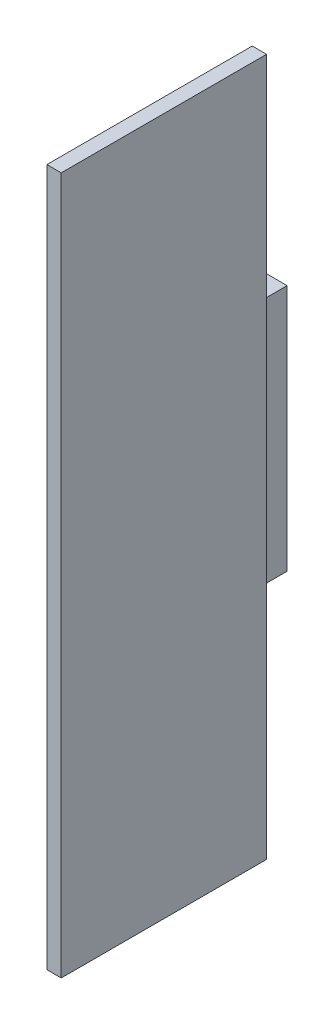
ISO-10303-21;
HEADER;
FILE_DESCRIPTION(('STEP AP214'),'2;1');
FILE_NAME('part.step','',(''),(''),'','','');
FILE_SCHEMA(('AUTOMOTIVE_DESIGN { 1 0 10303 214 1 1 1 1 }'));
ENDSEC;
DATA;
#1=APPLICATION_CONTEXT('core data for automotive mechanical design processes');
#2=APPLICATION_PROTOCOL_DEFINITION('international standard','automotive_design',2000,#1);
#3=PRODUCT_CONTEXT('',#1,'mechanical');
#4=PRODUCT('Part','Part','',(#3));
#5=PRODUCT_RELATED_PRODUCT_CATEGORY('part','',(#4));
#6=PRODUCT_DEFINITION_FORMATION('','',#4);
#7=PRODUCT_DEFINITION_CONTEXT('part definition',#1,'design');
#8=PRODUCT_DEFINITION('design','',#6,#7);
#9=PRODUCT_DEFINITION_SHAPE('','',#8);
#10=(LENGTH_UNIT() NAMED_UNIT(*) SI_UNIT(.MILLI.,.METRE.));
#11=(NAMED_UNIT(*) PLANE_ANGLE_UNIT() SI_UNIT($,.RADIAN.));
#12=(NAMED_UNIT(*) SI_UNIT($,.STERADIAN.) SOLID_ANGLE_UNIT());
#13=UNCERTAINTY_MEASURE_WITH_UNIT(LENGTH_MEASURE(1.E-05),#10,'distance_accuracy_value','');
#14=(GEOMETRIC_REPRESENTATION_CONTEXT(3) GLOBAL_UNCERTAINTY_ASSIGNED_CONTEXT((#13)) GLOBAL_UNIT_ASSIGNED_CONTEXT((#10,
#11,#12)) REPRESENTATION_CONTEXT('',''));
#15=CARTESIAN_POINT('',(0.,0.,0.));
#16=DIRECTION('',(0.,0.,1.));
#17=DIRECTION('',(1.,0.,0.));
#18=AXIS2_PLACEMENT_3D('',#15,#16,#17);
#19=CARTESIAN_POINT('',(0.,73.,43.));
#20=DIRECTION('',(-1.,0.,0.));
#21=DIRECTION('',(0.,-1.,0.));
#22=AXIS2_PLACEMENT_3D('',#19,#20,#21);
#23=PLANE('',#22);
#24=DIRECTION('',(0.,-1.,0.));
#25=VECTOR('',#24,1.);
#26=CARTESIAN_POINT('',(0.,-35.,7.69999999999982));
#27=LINE('',#26,#25);
#28=CARTESIAN_POINT('',(0.,35.,7.69999999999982));
#29=VERTEX_POINT('',#28);
#30=CARTESIAN_POINT('',(0.,-35.,7.69999999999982));
#31=VERTEX_POINT('',#30);
#32=EDGE_CURVE('E32',#29,#31,#27,.T.);
#33=ORIENTED_EDGE('',*,*,#32,.T.);
#34=DIRECTION('',(0.,0.,-1.));
#35=VECTOR('',#34,1.);
#36=CARTESIAN_POINT('',(0.,-35.,0.));
#37=LINE('',#36,#35);
#38=CARTESIAN_POINT('',(0.,-35.,0.));
#39=VERTEX_POINT('',#38);
#40=EDGE_CURVE('E18',#31,#39,#37,.T.);
#41=ORIENTED_EDGE('',*,*,#40,.T.);
#42=DIRECTION('',(0.,1.,0.));
#43=VECTOR('',#42,1.);
#44=CARTESIAN_POINT('',(0.,-73.,0.));
#45=LINE('',#44,#43);
#46=CARTESIAN_POINT('',(0.,-73.,0.));
#47=VERTEX_POINT('',#46);
#48=EDGE_CURVE('E178',#47,#39,#45,.T.);
#49=ORIENTED_EDGE('',*,*,#48,.F.);
#50=DIRECTION('',(0.,0.,-1.));
#51=VECTOR('',#50,1.);
#52=CARTESIAN_POINT('',(0.,-73.,43.));
#53=LINE('',#52,#51);
#54=CARTESIAN_POINT('',(0.,-73.,43.));
#55=VERTEX_POINT('',#54);
#56=EDGE_CURVE('E165',#55,#47,#53,.T.);
#57=ORIENTED_EDGE('',*,*,#56,.F.);
#58=DIRECTION('',(0.,-1.,0.));
#59=VECTOR('',#58,1.);
#60=CARTESIAN_POINT('',(0.,73.,43.));
#61=LINE('',#60,#59);
#62=CARTESIAN_POINT('',(0.,73.,43.));
#63=VERTEX_POINT('',#62);
#64=EDGE_CURVE('E155',#63,#55,#61,.T.);
#65=ORIENTED_EDGE('',*,*,#64,.F.);
#66=DIRECTION('',(0.,0.,1.));
#67=VECTOR('',#66,1.);
#68=CARTESIAN_POINT('',(0.,73.,0.));
#69=LINE('',#68,#67);
#70=CARTESIAN_POINT('',(0.,73.,0.));
#71=VERTEX_POINT('',#70);
#72=EDGE_CURVE('E170',#71,#63,#69,.T.);
#73=ORIENTED_EDGE('',*,*,#72,.F.);
#74=CARTESIAN_POINT('',(0.,34.9999999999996,0.));
#75=VERTEX_POINT('',#74);
#76=EDGE_CURVE('E167',#75,#71,#45,.T.);
#77=ORIENTED_EDGE('',*,*,#76,.F.);
#78=DIRECTION('',(0.,0.,1.));
#79=VECTOR('',#78,1.);
#80=CARTESIAN_POINT('',(0.,35.,7.69999999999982));
#81=LINE('',#80,#79);
#82=EDGE_CURVE('E125',#75,#29,#81,.T.);
#83=ORIENTED_EDGE('',*,*,#82,.T.);
#84=EDGE_LOOP('',(#33,#41,#49,#57,#65,#73,#77,#83));
#85=FACE_BOUND('',#84,.T.);
#86=ADVANCED_FACE('F14',(#85),#23,.T.);
#87=CARTESIAN_POINT('',(3.,73.,43.));
#88=DIRECTION('',(0.,0.,-1.));
#89=DIRECTION('',(0.,1.,0.));
#90=AXIS2_PLACEMENT_3D('',#87,#88,#89);
#91=PLANE('',#90);
#92=ORIENTED_EDGE('',*,*,#64,.T.);
#93=DIRECTION('',(-1.,0.,0.));
#94=VECTOR('',#93,1.);
#95=CARTESIAN_POINT('',(3.,-73.,43.));
#96=LINE('',#95,#94);
#97=CARTESIAN_POINT('',(3.,-73.,43.));
#98=VERTEX_POINT('',#97);
#99=EDGE_CURVE('E9',#98,#55,#96,.T.);
#100=ORIENTED_EDGE('',*,*,#99,.F.);
#101=DIRECTION('',(0.,-1.,0.));
#102=VECTOR('',#101,1.);
#103=CARTESIAN_POINT('',(3.,73.,43.));
#104=LINE('',#103,#102);
#105=CARTESIAN_POINT('',(3.,73.,43.));
#106=VERTEX_POINT('',#105);
#107=EDGE_CURVE('E196',#106,#98,#104,.T.);
#108=ORIENTED_EDGE('',*,*,#107,.F.);
#109=DIRECTION('',(-1.,0.,0.));
#110=VECTOR('',#109,1.);
#111=CARTESIAN_POINT('',(3.,73.,43.));
#112=LINE('',#111,#110);
#113=EDGE_CURVE('E193',#106,#63,#112,.T.);
#114=ORIENTED_EDGE('',*,*,#113,.T.);
#115=EDGE_LOOP('',(#92,#100,#108,#114));
#116=FACE_BOUND('',#115,.T.);
#117=ADVANCED_FACE('F16',(#116),#91,.F.);
#118=CARTESIAN_POINT('',(3.,-73.,43.));
#119=DIRECTION('',(0.,1.,0.));
#120=DIRECTION('',(0.,0.,1.));
#121=AXIS2_PLACEMENT_3D('',#118,#119,#120);
#122=PLANE('',#121);
#123=ORIENTED_EDGE('',*,*,#56,.T.);
#124=DIRECTION('',(-1.,0.,0.));
#125=VECTOR('',#124,1.);
#126=CARTESIAN_POINT('',(3.,-73.,0.));
#127=LINE('',#126,#125);
#128=CARTESIAN_POINT('',(3.,-73.,0.));
#129=VERTEX_POINT('',#128);
#130=EDGE_CURVE('E24',#129,#47,#127,.T.);
#131=ORIENTED_EDGE('',*,*,#130,.F.);
#132=DIRECTION('',(0.,0.,-1.));
#133=VECTOR('',#132,1.);
#134=CARTESIAN_POINT('',(3.,-73.,43.));
#135=LINE('',#134,#133);
#136=EDGE_CURVE('E197',#98,#129,#135,.T.);
#137=ORIENTED_EDGE('',*,*,#136,.F.);
#138=ORIENTED_EDGE('',*,*,#99,.T.);
#139=EDGE_LOOP('',(#123,#131,#137,#138));
#140=FACE_BOUND('',#139,.T.);
#141=ADVANCED_FACE('F208',(#140),#122,.F.);
#142=CARTESIAN_POINT('',(3.,-73.,0.));
#143=DIRECTION('',(0.,0.,1.));
#144=DIRECTION('',(1.,0.,0.));
#145=AXIS2_PLACEMENT_3D('',#142,#143,#144);
#146=PLANE('',#145);
#147=ORIENTED_EDGE('',*,*,#48,.T.);
#148=DIRECTION('',(1.,0.,0.));
#149=VECTOR('',#148,1.);
#150=CARTESIAN_POINT('',(-6.,-35.,0.));
#151=LINE('',#150,#149);
#152=CARTESIAN_POINT('',(-6.,-35.,0.));
#153=VERTEX_POINT('',#152);
#154=EDGE_CURVE('E113',#153,#39,#151,.T.);
#155=ORIENTED_EDGE('',*,*,#154,.F.);
#156=DIRECTION('',(0.,1.,0.));
#157=VECTOR('',#156,1.);
#158=CARTESIAN_POINT('',(-6.,-35.,0.));
#159=LINE('',#158,#157);
#160=CARTESIAN_POINT('',(-6.,-25.9,0.));
#161=VERTEX_POINT('',#160);
#162=EDGE_CURVE('E136',#153,#161,#159,.T.);
#163=ORIENTED_EDGE('',*,*,#162,.T.);
#164=DIRECTION('',(1.,0.,0.));
#165=VECTOR('',#164,1.);
#166=CARTESIAN_POINT('',(-6.,-25.9,0.));
#167=LINE('',#166,#165);
#168=CARTESIAN_POINT('',(0.,-25.9,0.));
#169=VERTEX_POINT('',#168);
#170=EDGE_CURVE('E161',#161,#169,#167,.T.);
#171=ORIENTED_EDGE('',*,*,#170,.T.);
#172=CARTESIAN_POINT('',(0.,25.9,0.));
#173=VERTEX_POINT('',#172);
#174=EDGE_CURVE('E179',#169,#173,#45,.T.);
#175=ORIENTED_EDGE('',*,*,#174,.T.);
#176=DIRECTION('',(1.,0.,0.));
#177=VECTOR('',#176,1.);
#178=CARTESIAN_POINT('',(-6.,25.9,0.));
#179=LINE('',#178,#177);
#180=CARTESIAN_POINT('',(-6.,25.9,0.));
#181=VERTEX_POINT('',#180);
#182=EDGE_CURVE('E159',#181,#173,#179,.T.);
#183=ORIENTED_EDGE('',*,*,#182,.F.);
#184=DIRECTION('',(0.,1.,0.));
#185=VECTOR('',#184,1.);
#186=CARTESIAN_POINT('',(-6.,25.9,0.));
#187=LINE('',#186,#185);
#188=CARTESIAN_POINT('',(-6.,34.9999999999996,0.));
#189=VERTEX_POINT('',#188);
#190=EDGE_CURVE('E148',#181,#189,#187,.T.);
#191=ORIENTED_EDGE('',*,*,#190,.T.);
#192=DIRECTION('',(1.,0.,0.));
#193=VECTOR('',#192,1.);
#194=CARTESIAN_POINT('',(-6.,34.9999999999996,0.));
#195=LINE('',#194,#193);
#196=EDGE_CURVE('E156',#189,#75,#195,.T.);
#197=ORIENTED_EDGE('',*,*,#196,.T.);
#198=ORIENTED_EDGE('',*,*,#76,.T.);
#199=DIRECTION('',(-1.,0.,0.));
#200=VECTOR('',#199,1.);
#201=CARTESIAN_POINT('',(3.,73.,0.));
#202=LINE('',#201,#200);
#203=CARTESIAN_POINT('',(3.,73.,0.));
#204=VERTEX_POINT('',#203);
#205=EDGE_CURVE('E188',#204,#71,#202,.T.);
#206=ORIENTED_EDGE('',*,*,#205,.F.);
#207=DIRECTION('',(0.,1.,0.));
#208=VECTOR('',#207,1.);
#209=CARTESIAN_POINT('',(3.,-73.,0.));
#210=LINE('',#209,#208);
#211=EDGE_CURVE('E200',#129,#204,#210,.T.);
#212=ORIENTED_EDGE('',*,*,#211,.F.);
#213=ORIENTED_EDGE('',*,*,#130,.T.);
#214=EDGE_LOOP('',(#147,#155,#163,#171,#175,#183,#191,#197,#198,#206,#212,#213));
#215=FACE_BOUND('',#214,.T.);
#216=ADVANCED_FACE('F186',(#215),#146,.F.);
#217=CARTESIAN_POINT('',(3.,73.,0.));
#218=DIRECTION('',(0.,-1.,0.));
#219=DIRECTION('',(0.,0.,-1.));
#220=AXIS2_PLACEMENT_3D('',#217,#218,#219);
#221=PLANE('',#220);
#222=ORIENTED_EDGE('',*,*,#72,.T.);
#223=ORIENTED_EDGE('',*,*,#113,.F.);
#224=DIRECTION('',(0.,0.,1.));
#225=VECTOR('',#224,1.);
#226=CARTESIAN_POINT('',(3.,73.,0.));
#227=LINE('',#226,#225);
#228=EDGE_CURVE('E40',#204,#106,#227,.T.);
#229=ORIENTED_EDGE('',*,*,#228,.F.);
#230=ORIENTED_EDGE('',*,*,#205,.T.);
#231=EDGE_LOOP('',(#222,#223,#229,#230));
#232=FACE_BOUND('',#231,.T.);
#233=ADVANCED_FACE('F191',(#232),#221,.F.);
#234=CARTESIAN_POINT('',(3.,73.,43.));
#235=DIRECTION('',(-1.,0.,0.));
#236=DIRECTION('',(0.,-1.,0.));
#237=AXIS2_PLACEMENT_3D('',#234,#235,#236);
#238=PLANE('',#237);
#239=ORIENTED_EDGE('',*,*,#107,.T.);
#240=ORIENTED_EDGE('',*,*,#136,.T.);
#241=ORIENTED_EDGE('',*,*,#211,.T.);
#242=ORIENTED_EDGE('',*,*,#228,.T.);
#243=EDGE_LOOP('',(#239,#240,#241,#242));
#244=FACE_BOUND('',#243,.T.);
#245=ADVANCED_FACE('F224',(#244),#238,.F.);
#246=CARTESIAN_POINT('',(0.,25.9,7.69999999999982));
#247=DIRECTION('',(1.,0.,0.));
#248=DIRECTION('',(0.,1.,0.));
#249=AXIS2_PLACEMENT_3D('',#246,#247,#248);
#250=PLANE('',#249);
#251=ORIENTED_EDGE('',*,*,#174,.F.);
#252=DIRECTION('',(0.,0.,-1.));
#253=VECTOR('',#252,1.);
#254=CARTESIAN_POINT('',(0.,-25.9,0.));
#255=LINE('',#254,#253);
#256=CARTESIAN_POINT('',(0.,-25.9,-7.30000000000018));
#257=VERTEX_POINT('',#256);
#258=EDGE_CURVE('E121',#169,#257,#255,.T.);
#259=ORIENTED_EDGE('',*,*,#258,.T.);
#260=DIRECTION('',(0.,1.,0.));
#261=VECTOR('',#260,1.);
#262=CARTESIAN_POINT('',(0.,-25.9,-7.30000000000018));
#263=LINE('',#262,#261);
#264=CARTESIAN_POINT('',(0.,25.9,-7.30000000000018));
#265=VERTEX_POINT('',#264);
#266=EDGE_CURVE('E129',#257,#265,#263,.T.);
#267=ORIENTED_EDGE('',*,*,#266,.T.);
#268=DIRECTION('',(0.,0.,1.));
#269=VECTOR('',#268,1.);
#270=CARTESIAN_POINT('',(0.,25.9,-7.30000000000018));
#271=LINE('',#270,#269);
#272=EDGE_CURVE('E132',#265,#173,#271,.T.);
#273=ORIENTED_EDGE('',*,*,#272,.T.);
#274=EDGE_LOOP('',(#251,#259,#267,#273));
#275=FACE_BOUND('',#274,.T.);
#276=ADVANCED_FACE('F227',(#275),#250,.T.);
#277=CARTESIAN_POINT('',(-6.,-35.,7.69999999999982));
#278=DIRECTION('',(0.,0.,1.));
#279=DIRECTION('',(1.,0.,0.));
#280=AXIS2_PLACEMENT_3D('',#277,#278,#279);
#281=PLANE('',#280);
#282=ORIENTED_EDGE('',*,*,#32,.F.);
#283=DIRECTION('',(1.,0.,0.));
#284=VECTOR('',#283,1.);
#285=CARTESIAN_POINT('',(-6.,35.,7.69999999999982));
#286=LINE('',#285,#284);
#287=CARTESIAN_POINT('',(-6.,35.,7.69999999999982));
#288=VERTEX_POINT('',#287);
#289=EDGE_CURVE('E153',#288,#29,#286,.T.);
#290=ORIENTED_EDGE('',*,*,#289,.F.);
#291=DIRECTION('',(0.,-1.,0.));
#292=VECTOR('',#291,1.);
#293=CARTESIAN_POINT('',(-6.,-35.,7.69999999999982));
#294=LINE('',#293,#292);
#295=CARTESIAN_POINT('',(-6.,-35.,7.69999999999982));
#296=VERTEX_POINT('',#295);
#297=EDGE_CURVE('E109',#288,#296,#294,.T.);
#298=ORIENTED_EDGE('',*,*,#297,.T.);
#299=DIRECTION('',(1.,0.,0.));
#300=VECTOR('',#299,1.);
#301=CARTESIAN_POINT('',(-6.,-35.,7.69999999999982));
#302=LINE('',#301,#300);
#303=EDGE_CURVE('E105',#296,#31,#302,.T.);
#304=ORIENTED_EDGE('',*,*,#303,.T.);
#305=EDGE_LOOP('',(#282,#290,#298,#304));
#306=FACE_BOUND('',#305,.T.);
#307=ADVANCED_FACE('F107',(#306),#281,.T.);
#308=CARTESIAN_POINT('',(-6.,35.,7.69999999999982));
#309=DIRECTION('',(0.,1.,0.));
#310=DIRECTION('',(0.,0.,1.));
#311=AXIS2_PLACEMENT_3D('',#308,#309,#310);
#312=PLANE('',#311);
#313=ORIENTED_EDGE('',*,*,#82,.F.);
#314=ORIENTED_EDGE('',*,*,#196,.F.);
#315=DIRECTION('',(0.,0.,1.));
#316=VECTOR('',#315,1.);
#317=CARTESIAN_POINT('',(-6.,35.,7.69999999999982));
#318=LINE('',#317,#316);
#319=EDGE_CURVE('E114',#189,#288,#318,.T.);
#320=ORIENTED_EDGE('',*,*,#319,.T.);
#321=ORIENTED_EDGE('',*,*,#289,.T.);
#322=EDGE_LOOP('',(#313,#314,#320,#321));
#323=FACE_BOUND('',#322,.T.);
#324=ADVANCED_FACE('F265',(#323),#312,.T.);
#325=CARTESIAN_POINT('',(-6.,25.9,-7.30000000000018));
#326=DIRECTION('',(0.,1.,0.));
#327=DIRECTION('',(-1.,0.,0.));
#328=AXIS2_PLACEMENT_3D('',#325,#326,#327);
#329=PLANE('',#328);
#330=ORIENTED_EDGE('',*,*,#272,.F.);
#331=DIRECTION('',(1.,0.,0.));
#332=VECTOR('',#331,1.);
#333=CARTESIAN_POINT('',(-6.,25.9,-7.30000000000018));
#334=LINE('',#333,#332);
#335=CARTESIAN_POINT('',(-6.,25.9,-7.30000000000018));
#336=VERTEX_POINT('',#335);
#337=EDGE_CURVE('E157',#336,#265,#334,.T.);
#338=ORIENTED_EDGE('',*,*,#337,.F.);
#339=DIRECTION('',(0.,0.,1.));
#340=VECTOR('',#339,1.);
#341=CARTESIAN_POINT('',(-6.,25.9,-7.30000000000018));
#342=LINE('',#341,#340);
#343=EDGE_CURVE('E145',#336,#181,#342,.T.);
#344=ORIENTED_EDGE('',*,*,#343,.T.);
#345=ORIENTED_EDGE('',*,*,#182,.T.);
#346=EDGE_LOOP('',(#330,#338,#344,#345));
#347=FACE_BOUND('',#346,.T.);
#348=ADVANCED_FACE('F272',(#347),#329,.T.);
#349=CARTESIAN_POINT('',(-6.,-25.9,-7.30000000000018));
#350=DIRECTION('',(0.,0.,-1.));
#351=DIRECTION('',(-1.,0.,0.));
#352=AXIS2_PLACEMENT_3D('',#349,#350,#351);
#353=PLANE('',#352);
#354=ORIENTED_EDGE('',*,*,#266,.F.);
#355=DIRECTION('',(1.,0.,0.));
#356=VECTOR('',#355,1.);
#357=CARTESIAN_POINT('',(-6.,-25.9,-7.30000000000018));
#358=LINE('',#357,#356);
#359=CARTESIAN_POINT('',(-6.,-25.9,-7.30000000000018));
#360=VERTEX_POINT('',#359);
#361=EDGE_CURVE('E160',#360,#257,#358,.T.);
#362=ORIENTED_EDGE('',*,*,#361,.F.);
#363=DIRECTION('',(0.,1.,0.));
#364=VECTOR('',#363,1.);
#365=CARTESIAN_POINT('',(-6.,-25.9,-7.30000000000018));
#366=LINE('',#365,#364);
#367=EDGE_CURVE('E142',#360,#336,#366,.T.);
#368=ORIENTED_EDGE('',*,*,#367,.T.);
#369=ORIENTED_EDGE('',*,*,#337,.T.);
#370=EDGE_LOOP('',(#354,#362,#368,#369));
#371=FACE_BOUND('',#370,.T.);
#372=ADVANCED_FACE('F281',(#371),#353,.T.);
#373=CARTESIAN_POINT('',(-6.,-25.9,0.));
#374=DIRECTION('',(0.,-1.,0.));
#375=DIRECTION('',(1.,0.,0.));
#376=AXIS2_PLACEMENT_3D('',#373,#374,#375);
#377=PLANE('',#376);
#378=ORIENTED_EDGE('',*,*,#258,.F.);
#379=ORIENTED_EDGE('',*,*,#170,.F.);
#380=DIRECTION('',(0.,0.,-1.));
#381=VECTOR('',#380,1.);
#382=CARTESIAN_POINT('',(-6.,-25.9,0.));
#383=LINE('',#382,#381);
#384=EDGE_CURVE('E139',#161,#360,#383,.T.);
#385=ORIENTED_EDGE('',*,*,#384,.T.);
#386=ORIENTED_EDGE('',*,*,#361,.T.);
#387=EDGE_LOOP('',(#378,#379,#385,#386));
#388=FACE_BOUND('',#387,.T.);
#389=ADVANCED_FACE('F290',(#388),#377,.T.);
#390=CARTESIAN_POINT('',(-6.,-35.,0.));
#391=DIRECTION('',(0.,-1.,0.));
#392=DIRECTION('',(1.,0.,0.));
#393=AXIS2_PLACEMENT_3D('',#390,#391,#392);
#394=PLANE('',#393);
#395=ORIENTED_EDGE('',*,*,#40,.F.);
#396=ORIENTED_EDGE('',*,*,#303,.F.);
#397=DIRECTION('',(0.,0.,-1.));
#398=VECTOR('',#397,1.);
#399=CARTESIAN_POINT('',(-6.,-35.,0.));
#400=LINE('',#399,#398);
#401=EDGE_CURVE('E134',#296,#153,#400,.T.);
#402=ORIENTED_EDGE('',*,*,#401,.T.);
#403=ORIENTED_EDGE('',*,*,#154,.T.);
#404=EDGE_LOOP('',(#395,#396,#402,#403));
#405=FACE_BOUND('',#404,.T.);
#406=ADVANCED_FACE('F117',(#405),#394,.T.);
#407=CARTESIAN_POINT('',(-6.,25.9,7.69999999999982));
#408=DIRECTION('',(1.,0.,0.));
#409=DIRECTION('',(0.,1.,0.));
#410=AXIS2_PLACEMENT_3D('',#407,#408,#409);
#411=PLANE('',#410);
#412=ORIENTED_EDGE('',*,*,#297,.F.);
#413=ORIENTED_EDGE('',*,*,#319,.F.);
#414=ORIENTED_EDGE('',*,*,#190,.F.);
#415=ORIENTED_EDGE('',*,*,#343,.F.);
#416=ORIENTED_EDGE('',*,*,#367,.F.);
#417=ORIENTED_EDGE('',*,*,#384,.F.);
#418=ORIENTED_EDGE('',*,*,#162,.F.);
#419=ORIENTED_EDGE('',*,*,#401,.F.);
#420=EDGE_LOOP('',(#412,#413,#414,#415,#416,#417,#418,#419));
#421=FACE_BOUND('',#420,.T.);
#422=ADVANCED_FACE('F307',(#421),#411,.F.);
#423=CLOSED_SHELL('',(#86,#117,#141,#216,#233,#245,#276,#307,#324,#348,#372,#389,#406,#422));
#424=MANIFOLD_SOLID_BREP('B1',#423);
#425=ADVANCED_BREP_SHAPE_REPRESENTATION('',(#18,#424),#14);
#426=SHAPE_DEFINITION_REPRESENTATION(#9,#425);
ENDSEC;
END-ISO-10303-21;
